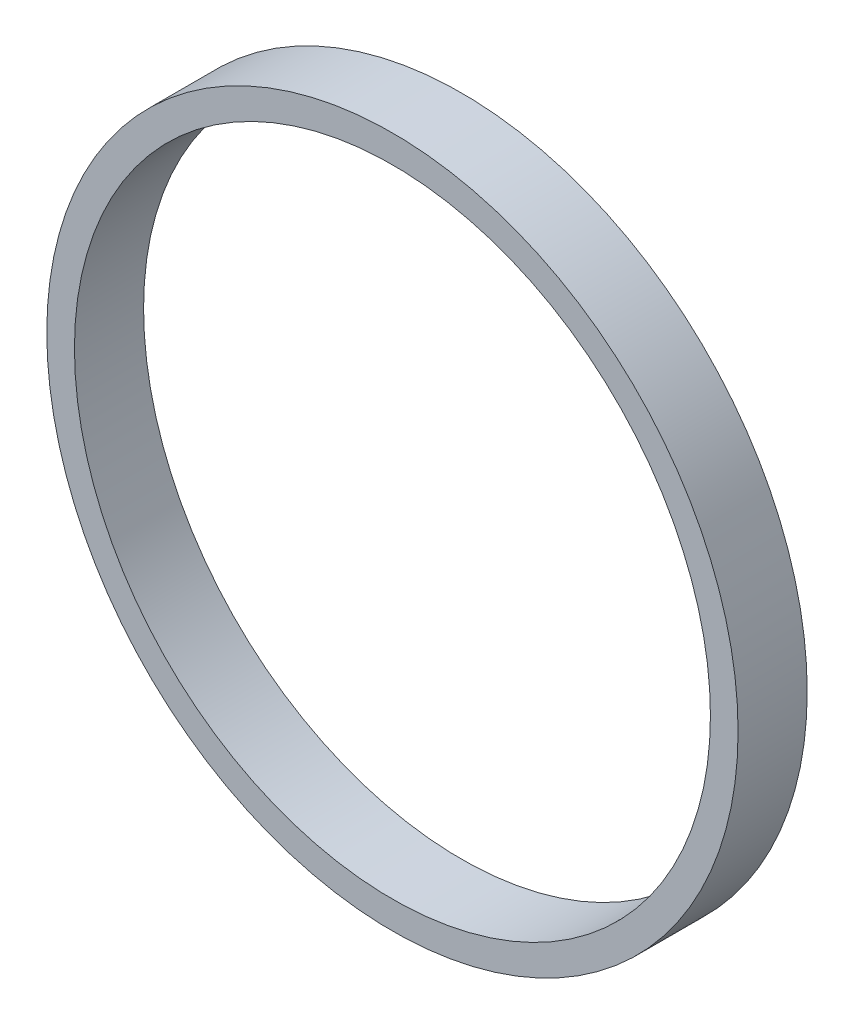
ISO-10303-21;
HEADER;
FILE_DESCRIPTION(('STEP AP214'),'2;1');
FILE_NAME('part.step','',(''),(''),'','','');
FILE_SCHEMA(('AUTOMOTIVE_DESIGN { 1 0 10303 214 1 1 1 1 }'));
ENDSEC;
DATA;
#1=APPLICATION_CONTEXT('core data for automotive mechanical design processes');
#2=APPLICATION_PROTOCOL_DEFINITION('international standard','automotive_design',2000,#1);
#3=PRODUCT_CONTEXT('',#1,'mechanical');
#4=PRODUCT('Part','Part','',(#3));
#5=PRODUCT_RELATED_PRODUCT_CATEGORY('part','',(#4));
#6=PRODUCT_DEFINITION_FORMATION('','',#4);
#7=PRODUCT_DEFINITION_CONTEXT('part definition',#1,'design');
#8=PRODUCT_DEFINITION('design','',#6,#7);
#9=PRODUCT_DEFINITION_SHAPE('','',#8);
#10=(LENGTH_UNIT() NAMED_UNIT(*) SI_UNIT(.MILLI.,.METRE.));
#11=(NAMED_UNIT(*) PLANE_ANGLE_UNIT() SI_UNIT($,.RADIAN.));
#12=(NAMED_UNIT(*) SI_UNIT($,.STERADIAN.) SOLID_ANGLE_UNIT());
#13=UNCERTAINTY_MEASURE_WITH_UNIT(LENGTH_MEASURE(1.E-05),#10,'distance_accuracy_value','');
#14=(GEOMETRIC_REPRESENTATION_CONTEXT(3) GLOBAL_UNCERTAINTY_ASSIGNED_CONTEXT((#13)) GLOBAL_UNIT_ASSIGNED_CONTEXT((#10,
#11,#12)) REPRESENTATION_CONTEXT('',''));
#15=CARTESIAN_POINT('',(0.,0.,0.));
#16=DIRECTION('',(0.,0.,1.));
#17=DIRECTION('',(1.,0.,0.));
#18=AXIS2_PLACEMENT_3D('',#15,#16,#17);
#19=CARTESIAN_POINT('',(0.,0.,5.));
#20=DIRECTION('',(0.,0.,1.));
#21=DIRECTION('',(1.,0.,0.));
#22=AXIS2_PLACEMENT_3D('',#19,#20,#21);
#23=PLANE('',#22);
#24=CARTESIAN_POINT('',(0.,0.,5.));
#25=DIRECTION('',(0.,0.,1.));
#26=DIRECTION('',(1.,0.,0.));
#27=AXIS2_PLACEMENT_3D('',#24,#25,#26);
#28=CIRCLE('',#27,25.);
#29=CARTESIAN_POINT('',(25.,0.,5.));
#30=VERTEX_POINT('',#29);
#31=EDGE_CURVE('E10',#30,#30,#28,.T.);
#32=ORIENTED_EDGE('',*,*,#31,.T.);
#33=EDGE_LOOP('',(#32));
#34=FACE_BOUND('',#33,.T.);
#35=CARTESIAN_POINT('',(0.,0.,5.));
#36=DIRECTION('',(0.,0.,1.));
#37=DIRECTION('',(1.,0.,0.));
#38=AXIS2_PLACEMENT_3D('',#35,#36,#37);
#39=CIRCLE('',#38,23.);
#40=CARTESIAN_POINT('',(23.,0.,5.));
#41=VERTEX_POINT('',#40);
#42=EDGE_CURVE('E54',#41,#41,#39,.T.);
#43=ORIENTED_EDGE('',*,*,#42,.F.);
#44=EDGE_LOOP('',(#43));
#45=FACE_BOUND('',#44,.T.);
#46=ADVANCED_FACE('F41',(#34,#45),#23,.T.);
#47=CARTESIAN_POINT('',(0.,0.,0.));
#48=DIRECTION('',(0.,0.,1.));
#49=DIRECTION('',(1.,0.,0.));
#50=AXIS2_PLACEMENT_3D('',#47,#48,#49);
#51=PLANE('',#50);
#52=CARTESIAN_POINT('',(0.,0.,0.));
#53=DIRECTION('',(0.,0.,1.));
#54=DIRECTION('',(1.,0.,0.));
#55=AXIS2_PLACEMENT_3D('',#52,#53,#54);
#56=CIRCLE('',#55,25.);
#57=CARTESIAN_POINT('',(25.,0.,0.));
#58=VERTEX_POINT('',#57);
#59=EDGE_CURVE('E45',#58,#58,#56,.T.);
#60=ORIENTED_EDGE('',*,*,#59,.F.);
#61=EDGE_LOOP('',(#60));
#62=FACE_BOUND('',#61,.T.);
#63=CARTESIAN_POINT('',(0.,0.,0.));
#64=DIRECTION('',(0.,0.,1.));
#65=DIRECTION('',(1.,0.,0.));
#66=AXIS2_PLACEMENT_3D('',#63,#64,#65);
#67=CIRCLE('',#66,23.);
#68=CARTESIAN_POINT('',(23.,0.,0.));
#69=VERTEX_POINT('',#68);
#70=EDGE_CURVE('E56',#69,#69,#67,.T.);
#71=ORIENTED_EDGE('',*,*,#70,.T.);
#72=EDGE_LOOP('',(#71));
#73=FACE_BOUND('',#72,.T.);
#74=ADVANCED_FACE('F68',(#62,#73),#51,.F.);
#75=CARTESIAN_POINT('',(0.,0.,5.));
#76=DIRECTION('',(0.,0.,-1.));
#77=DIRECTION('',(-1.,0.,0.));
#78=AXIS2_PLACEMENT_3D('',#75,#76,#77);
#79=CYLINDRICAL_SURFACE('',#78,25.);
#80=ORIENTED_EDGE('',*,*,#31,.F.);
#81=EDGE_LOOP('',(#80));
#82=FACE_BOUND('',#81,.T.);
#83=ORIENTED_EDGE('',*,*,#59,.T.);
#84=EDGE_LOOP('',(#83));
#85=FACE_BOUND('',#84,.T.);
#86=ADVANCED_FACE('F43',(#82,#85),#79,.T.);
#87=CARTESIAN_POINT('',(0.,0.,5.));
#88=DIRECTION('',(0.,0.,-1.));
#89=DIRECTION('',(-1.,0.,0.));
#90=AXIS2_PLACEMENT_3D('',#87,#88,#89);
#91=CYLINDRICAL_SURFACE('',#90,23.);
#92=ORIENTED_EDGE('',*,*,#42,.T.);
#93=EDGE_LOOP('',(#92));
#94=FACE_BOUND('',#93,.T.);
#95=ORIENTED_EDGE('',*,*,#70,.F.);
#96=EDGE_LOOP('',(#95));
#97=FACE_BOUND('',#96,.T.);
#98=ADVANCED_FACE('F64',(#94,#97),#91,.F.);
#99=CLOSED_SHELL('',(#46,#74,#86,#98));
#100=MANIFOLD_SOLID_BREP('B2',#99);
#101=ADVANCED_BREP_SHAPE_REPRESENTATION('',(#18,#100),#14);
#102=SHAPE_DEFINITION_REPRESENTATION(#9,#101);
ENDSEC;
END-ISO-10303-21;
